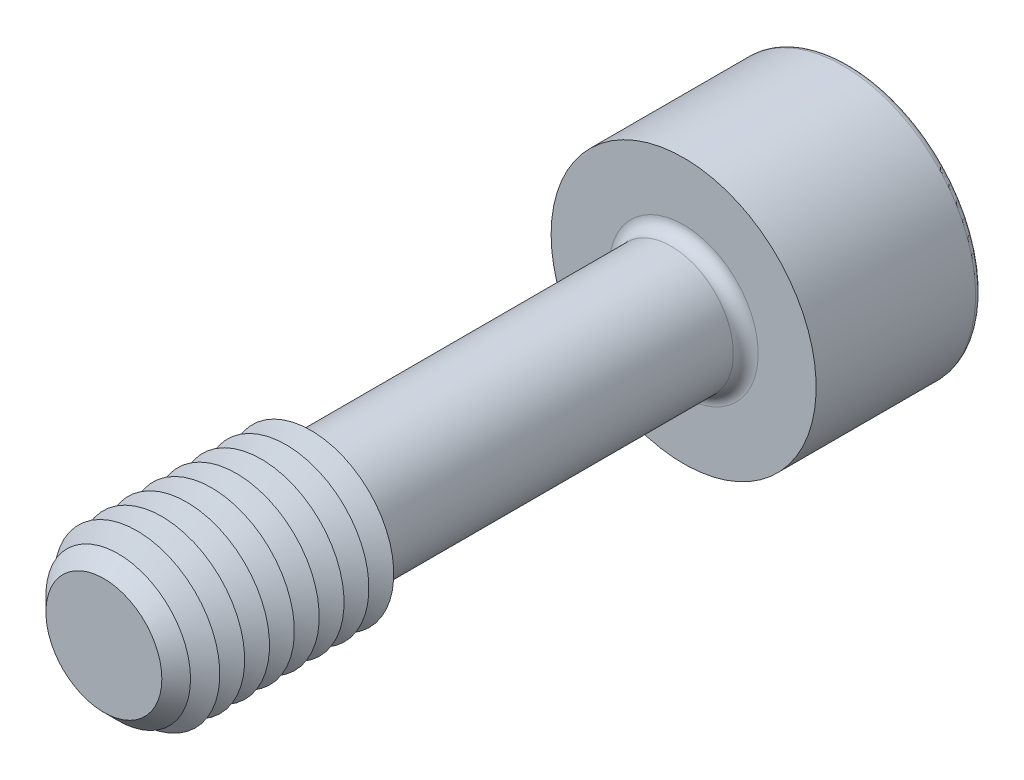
from build123d import *

# Parameters (mm, degrees)
SKETCH1_R       = 3.75
EXTRUDE1_DEPTH  = 17.5
CHAMFER1_SIZE   = 1.5
SKETCH3_R       = 8
EXTRUDE2_DEPTH  = 10
EXTRUDE3_DEPTH  = 8
FILLET1_R       = 0.75
FILLET2_R       = 0.375
LPATTERN1_COUNT = 8
LPATTERN1_PITCH = 1.5


with BuildPart() as part:
    # Sketch1 → Extrude1 (new, symmetric)
    with BuildSketch(Plane.XY):
        Circle(SKETCH1_R)
    extrude(amount=EXTRUDE1_DEPTH, both=True)

    # Sketch2 → Revolve1 (revolve)
    with BuildSketch(Plane(origin=(0, 0, 0), x_dir=(0, 0, -1), z_dir=(1, 0, 0))):
        Polygon((-17.5, 0), (-17.5, 5), (-5, 5), (-4.278312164, 3.75), (-4.278312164, 0), align=None)
    revolve(axis=Axis((0, 0, 4.278312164), (0, 0, 1)))

    # Chamfer1
    chamfer1_edges = [part.edges().sort_by_distance(p)[0] for p in [
        (0, -5, 17.5),
    ]]
    chamfer(chamfer1_edges, length=CHAMFER1_SIZE)

    # Sketch3 → Extrude2 (add)
    with BuildSketch(Plane(origin=(0, 0, -17.5), x_dir=(-1, 0, 0), z_dir=(0, 0, -1))):
        Circle(SKETCH3_R)
    extrude(amount=EXTRUDE2_DEPTH)

    # Sketch4 → Extrude3 (cut)
    with BuildSketch(Plane(origin=(-13.7, 0, -27.5), x_dir=(1, 0, 0), z_dir=(0, 0, 1))):
        Polygon((11.390598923, -4), (16.009401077, -4), (18.318802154, 0), (16.009401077, 4), (11.390598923, 4), (9.081197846, 0), align=None)
    extrude(amount=EXTRUDE3_DEPTH, mode=Mode.SUBTRACT)

    # Fillet1
    fillet1_edges = [part.edges().sort_by_distance(p)[0] for p in [
        (-3.75, 0, -17.5),
    ]]
    fillet(fillet1_edges, radius=FILLET1_R)

    # Fillet2
    fillet2_edges = [part.edges().sort_by_distance(p)[0] for p in [
        (8, 0, -27.5),
    ]]
    fillet(fillet2_edges, radius=FILLET2_R)

    # Sketch5 → Cut-Revolve1 (revolve, cut)
    with BuildSketch(Plane(origin=(0, 0, 0), x_dir=(0, 0, -1), z_dir=(1, 0, 0)), mode=Mode.PRIVATE) as cut_revolve1_sk:
        Polygon((19.5, 0), (19.5, -4), (17.190598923, 0), align=None)
    revolve(cut_revolve1_sk.sketch.rotate(Axis((0, 0, -17.190598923), (0, 0, -1)), 90), axis=Axis((0, 0, -17.190598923), (0, 0, -1)), mode=Mode.SUBTRACT)

    # Sketch7 → Cut-Revolve2 (revolve, cut)
    with BuildSketch(Plane(origin=(0, 0, 0), x_dir=(0, 0, -1), z_dir=(1, 0, 0)), mode=Mode.PRIVATE) as cut_revolve2_sk:
        Polygon((-5, 5), (-5.75, 3.700961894), (-6.5, 5), align=None)
    cut_revolve2 = revolve(cut_revolve2_sk.sketch.rotate(Axis((0, 0, -1.332048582), (0, 0, 1)), 90), axis=Axis((0, 0, -1.332048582), (0, 0, 1)), mode=Mode.SUBTRACT)

    # LPattern1: Cut-Revolve2 ×8
    with Locations(*[(0, 0, i * LPATTERN1_PITCH) for i in range(1, LPATTERN1_COUNT)]):
        add(cut_revolve2, mode=Mode.SUBTRACT)


solid = part.part
